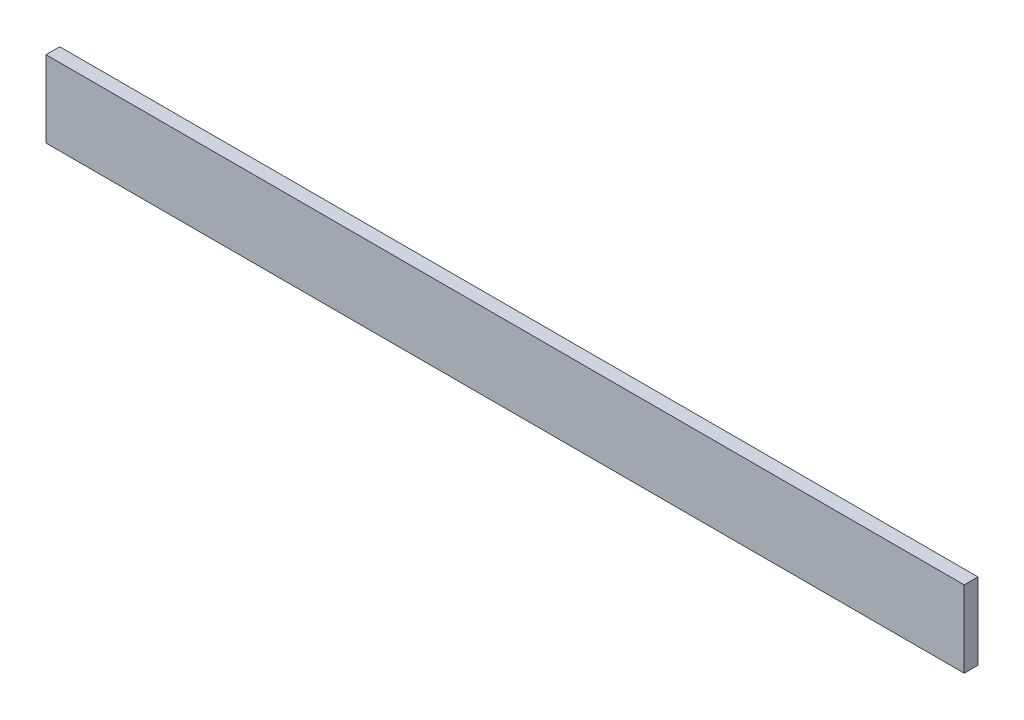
ISO-10303-21;
HEADER;
FILE_DESCRIPTION(('STEP AP214'),'2;1');
FILE_NAME('part.step','',(''),(''),'','','');
FILE_SCHEMA(('AUTOMOTIVE_DESIGN { 1 0 10303 214 1 1 1 1 }'));
ENDSEC;
DATA;
#1=APPLICATION_CONTEXT('core data for automotive mechanical design processes');
#2=APPLICATION_PROTOCOL_DEFINITION('international standard','automotive_design',2000,#1);
#3=PRODUCT_CONTEXT('',#1,'mechanical');
#4=PRODUCT('Part','Part','',(#3));
#5=PRODUCT_RELATED_PRODUCT_CATEGORY('part','',(#4));
#6=PRODUCT_DEFINITION_FORMATION('','',#4);
#7=PRODUCT_DEFINITION_CONTEXT('part definition',#1,'design');
#8=PRODUCT_DEFINITION('design','',#6,#7);
#9=PRODUCT_DEFINITION_SHAPE('','',#8);
#10=(LENGTH_UNIT() NAMED_UNIT(*) SI_UNIT(.MILLI.,.METRE.));
#11=(NAMED_UNIT(*) PLANE_ANGLE_UNIT() SI_UNIT($,.RADIAN.));
#12=(NAMED_UNIT(*) SI_UNIT($,.STERADIAN.) SOLID_ANGLE_UNIT());
#13=UNCERTAINTY_MEASURE_WITH_UNIT(LENGTH_MEASURE(1.E-05),#10,'distance_accuracy_value','');
#14=(GEOMETRIC_REPRESENTATION_CONTEXT(3) GLOBAL_UNCERTAINTY_ASSIGNED_CONTEXT((#13)) GLOBAL_UNIT_ASSIGNED_CONTEXT((#10,
#11,#12)) REPRESENTATION_CONTEXT('',''));
#15=CARTESIAN_POINT('',(0.,0.,0.));
#16=DIRECTION('',(0.,0.,1.));
#17=DIRECTION('',(1.,0.,0.));
#18=AXIS2_PLACEMENT_3D('',#15,#16,#17);
#19=CARTESIAN_POINT('',(600.,50.,18.));
#20=DIRECTION('',(-1.,0.,0.));
#21=DIRECTION('',(0.,0.,1.));
#22=AXIS2_PLACEMENT_3D('',#19,#20,#21);
#23=PLANE('',#22);
#24=DIRECTION('',(0.,1.,0.));
#25=VECTOR('',#24,1.);
#26=CARTESIAN_POINT('',(600.,50.,0.));
#27=LINE('',#26,#25);
#28=CARTESIAN_POINT('',(600.,-50.,0.));
#29=VERTEX_POINT('',#28);
#30=CARTESIAN_POINT('',(600.,50.,0.));
#31=VERTEX_POINT('',#30);
#32=EDGE_CURVE('E95',#29,#31,#27,.T.);
#33=ORIENTED_EDGE('',*,*,#32,.T.);
#34=DIRECTION('',(0.,0.,-1.));
#35=VECTOR('',#34,1.);
#36=CARTESIAN_POINT('',(600.,50.,18.));
#37=LINE('',#36,#35);
#38=CARTESIAN_POINT('',(600.,50.,18.));
#39=VERTEX_POINT('',#38);
#40=EDGE_CURVE('E11',#39,#31,#37,.T.);
#41=ORIENTED_EDGE('',*,*,#40,.F.);
#42=DIRECTION('',(0.,1.,0.));
#43=VECTOR('',#42,1.);
#44=CARTESIAN_POINT('',(600.,50.,18.));
#45=LINE('',#44,#43);
#46=CARTESIAN_POINT('',(600.,-50.,18.));
#47=VERTEX_POINT('',#46);
#48=EDGE_CURVE('E83',#47,#39,#45,.T.);
#49=ORIENTED_EDGE('',*,*,#48,.F.);
#50=DIRECTION('',(0.,0.,-1.));
#51=VECTOR('',#50,1.);
#52=CARTESIAN_POINT('',(600.,-50.,18.));
#53=LINE('',#52,#51);
#54=EDGE_CURVE('E91',#47,#29,#53,.T.);
#55=ORIENTED_EDGE('',*,*,#54,.T.);
#56=EDGE_LOOP('',(#33,#41,#49,#55));
#57=FACE_BOUND('',#56,.T.);
#58=ADVANCED_FACE('F32',(#57),#23,.F.);
#59=CARTESIAN_POINT('',(-600.,50.,18.));
#60=DIRECTION('',(0.,-1.,0.));
#61=DIRECTION('',(0.,0.,-1.));
#62=AXIS2_PLACEMENT_3D('',#59,#60,#61);
#63=PLANE('',#62);
#64=DIRECTION('',(-1.,0.,0.));
#65=VECTOR('',#64,1.);
#66=CARTESIAN_POINT('',(-600.,50.,0.));
#67=LINE('',#66,#65);
#68=CARTESIAN_POINT('',(-600.,50.,0.));
#69=VERTEX_POINT('',#68);
#70=EDGE_CURVE('E87',#31,#69,#67,.T.);
#71=ORIENTED_EDGE('',*,*,#70,.T.);
#72=DIRECTION('',(0.,0.,-1.));
#73=VECTOR('',#72,1.);
#74=CARTESIAN_POINT('',(-600.,50.,18.));
#75=LINE('',#74,#73);
#76=CARTESIAN_POINT('',(-600.,50.,18.));
#77=VERTEX_POINT('',#76);
#78=EDGE_CURVE('E40',#77,#69,#75,.T.);
#79=ORIENTED_EDGE('',*,*,#78,.F.);
#80=DIRECTION('',(-1.,0.,0.));
#81=VECTOR('',#80,1.);
#82=CARTESIAN_POINT('',(-600.,50.,18.));
#83=LINE('',#82,#81);
#84=EDGE_CURVE('E78',#39,#77,#83,.T.);
#85=ORIENTED_EDGE('',*,*,#84,.F.);
#86=ORIENTED_EDGE('',*,*,#40,.T.);
#87=EDGE_LOOP('',(#71,#79,#85,#86));
#88=FACE_BOUND('',#87,.T.);
#89=ADVANCED_FACE('F86',(#88),#63,.F.);
#90=CARTESIAN_POINT('',(-600.,50.,18.));
#91=DIRECTION('',(1.,0.,0.));
#92=DIRECTION('',(0.,0.,-1.));
#93=AXIS2_PLACEMENT_3D('',#90,#91,#92);
#94=PLANE('',#93);
#95=DIRECTION('',(0.,-1.,0.));
#96=VECTOR('',#95,1.);
#97=CARTESIAN_POINT('',(-600.,50.,0.));
#98=LINE('',#97,#96);
#99=CARTESIAN_POINT('',(-600.,-50.,0.));
#100=VERTEX_POINT('',#99);
#101=EDGE_CURVE('E65',#69,#100,#98,.T.);
#102=ORIENTED_EDGE('',*,*,#101,.T.);
#103=DIRECTION('',(0.,0.,-1.));
#104=VECTOR('',#103,1.);
#105=CARTESIAN_POINT('',(-600.,-50.,18.));
#106=LINE('',#105,#104);
#107=CARTESIAN_POINT('',(-600.,-50.,18.));
#108=VERTEX_POINT('',#107);
#109=EDGE_CURVE('E88',#108,#100,#106,.T.);
#110=ORIENTED_EDGE('',*,*,#109,.F.);
#111=DIRECTION('',(0.,-1.,0.));
#112=VECTOR('',#111,1.);
#113=CARTESIAN_POINT('',(-600.,50.,18.));
#114=LINE('',#113,#112);
#115=EDGE_CURVE('E81',#77,#108,#114,.T.);
#116=ORIENTED_EDGE('',*,*,#115,.F.);
#117=ORIENTED_EDGE('',*,*,#78,.T.);
#118=EDGE_LOOP('',(#102,#110,#116,#117));
#119=FACE_BOUND('',#118,.T.);
#120=ADVANCED_FACE('F89',(#119),#94,.F.);
#121=CARTESIAN_POINT('',(-600.,-50.,18.));
#122=DIRECTION('',(0.,1.,0.));
#123=DIRECTION('',(0.,0.,1.));
#124=AXIS2_PLACEMENT_3D('',#121,#122,#123);
#125=PLANE('',#124);
#126=DIRECTION('',(1.,0.,0.));
#127=VECTOR('',#126,1.);
#128=CARTESIAN_POINT('',(-600.,-50.,0.));
#129=LINE('',#128,#127);
#130=EDGE_CURVE('E71',#100,#29,#129,.T.);
#131=ORIENTED_EDGE('',*,*,#130,.T.);
#132=ORIENTED_EDGE('',*,*,#54,.F.);
#133=DIRECTION('',(1.,0.,0.));
#134=VECTOR('',#133,1.);
#135=CARTESIAN_POINT('',(-600.,-50.,18.));
#136=LINE('',#135,#134);
#137=EDGE_CURVE('E48',#108,#47,#136,.T.);
#138=ORIENTED_EDGE('',*,*,#137,.F.);
#139=ORIENTED_EDGE('',*,*,#109,.T.);
#140=EDGE_LOOP('',(#131,#132,#138,#139));
#141=FACE_BOUND('',#140,.T.);
#142=ADVANCED_FACE('F102',(#141),#125,.F.);
#143=CARTESIAN_POINT('',(0.,0.,18.));
#144=DIRECTION('',(0.,0.,1.));
#145=DIRECTION('',(1.,0.,0.));
#146=AXIS2_PLACEMENT_3D('',#143,#144,#145);
#147=PLANE('',#146);
#148=ORIENTED_EDGE('',*,*,#48,.T.);
#149=ORIENTED_EDGE('',*,*,#84,.T.);
#150=ORIENTED_EDGE('',*,*,#115,.T.);
#151=ORIENTED_EDGE('',*,*,#137,.T.);
#152=EDGE_LOOP('',(#148,#149,#150,#151));
#153=FACE_BOUND('',#152,.T.);
#154=ADVANCED_FACE('F79',(#153),#147,.T.);
#155=CARTESIAN_POINT('',(0.,0.,0.));
#156=DIRECTION('',(0.,0.,1.));
#157=DIRECTION('',(1.,0.,0.));
#158=AXIS2_PLACEMENT_3D('',#155,#156,#157);
#159=PLANE('',#158);
#160=ORIENTED_EDGE('',*,*,#32,.F.);
#161=ORIENTED_EDGE('',*,*,#130,.F.);
#162=ORIENTED_EDGE('',*,*,#101,.F.);
#163=ORIENTED_EDGE('',*,*,#70,.F.);
#164=EDGE_LOOP('',(#160,#161,#162,#163));
#165=FACE_BOUND('',#164,.T.);
#166=ADVANCED_FACE('F105',(#165),#159,.F.);
#167=CLOSED_SHELL('',(#58,#89,#120,#142,#154,#166));
#168=MANIFOLD_SOLID_BREP('B2',#167);
#169=ADVANCED_BREP_SHAPE_REPRESENTATION('',(#18,#168),#14);
#170=SHAPE_DEFINITION_REPRESENTATION(#9,#169);
ENDSEC;
END-ISO-10303-21;
